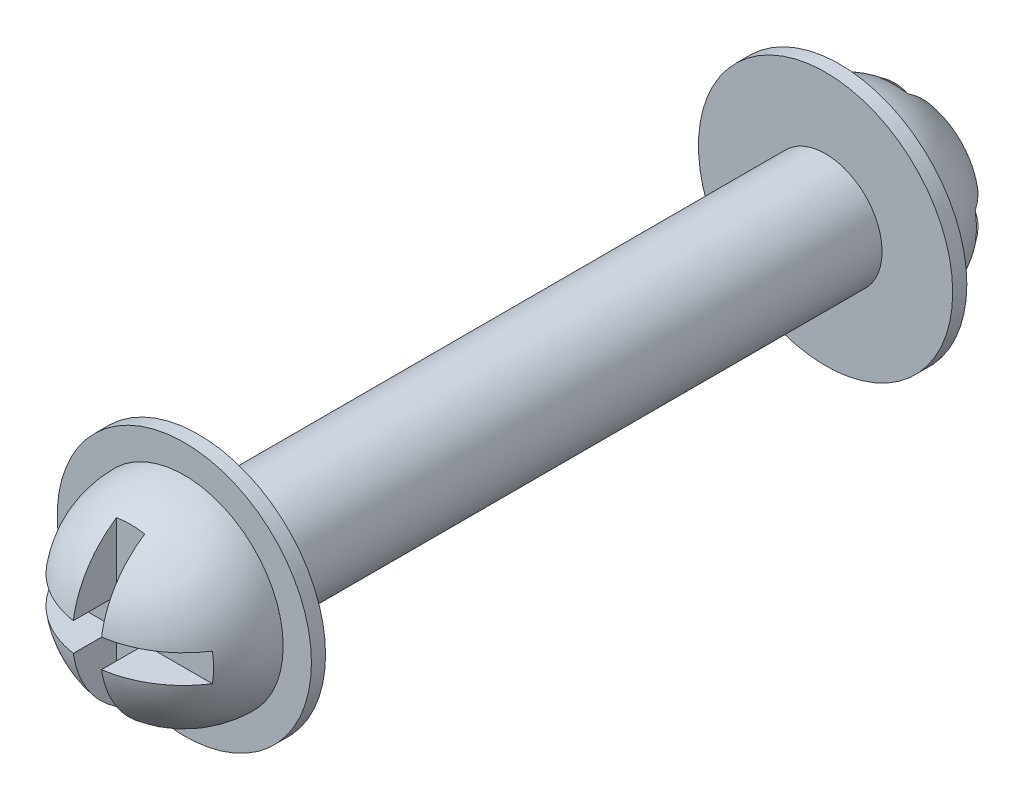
ISO-10303-21;
HEADER;
FILE_DESCRIPTION(('STEP AP214'),'2;1');
FILE_NAME('part.step','',(''),(''),'','','');
FILE_SCHEMA(('AUTOMOTIVE_DESIGN { 1 0 10303 214 1 1 1 1 }'));
ENDSEC;
DATA;
#1=APPLICATION_CONTEXT('core data for automotive mechanical design processes');
#2=APPLICATION_PROTOCOL_DEFINITION('international standard','automotive_design',2000,#1);
#3=PRODUCT_CONTEXT('',#1,'mechanical');
#4=PRODUCT('Part','Part','',(#3));
#5=PRODUCT_RELATED_PRODUCT_CATEGORY('part','',(#4));
#6=PRODUCT_DEFINITION_FORMATION('','',#4);
#7=PRODUCT_DEFINITION_CONTEXT('part definition',#1,'design');
#8=PRODUCT_DEFINITION('design','',#6,#7);
#9=PRODUCT_DEFINITION_SHAPE('','',#8);
#10=(LENGTH_UNIT() NAMED_UNIT(*) SI_UNIT(.MILLI.,.METRE.));
#11=(NAMED_UNIT(*) PLANE_ANGLE_UNIT() SI_UNIT($,.RADIAN.));
#12=(NAMED_UNIT(*) SI_UNIT($,.STERADIAN.) SOLID_ANGLE_UNIT());
#13=UNCERTAINTY_MEASURE_WITH_UNIT(LENGTH_MEASURE(1.E-05),#10,'distance_accuracy_value','');
#14=(GEOMETRIC_REPRESENTATION_CONTEXT(3) GLOBAL_UNCERTAINTY_ASSIGNED_CONTEXT((#13)) GLOBAL_UNIT_ASSIGNED_CONTEXT((#10,
#11,#12)) REPRESENTATION_CONTEXT('',''));
#15=CARTESIAN_POINT('',(0.,0.,0.));
#16=DIRECTION('',(0.,0.,1.));
#17=DIRECTION('',(1.,0.,0.));
#18=AXIS2_PLACEMENT_3D('',#15,#16,#17);
#19=CARTESIAN_POINT('',(-14.2875,1.5875,-49.2125));
#20=DIRECTION('',(0.,1.,0.));
#21=DIRECTION('',(0.,0.,1.));
#22=AXIS2_PLACEMENT_3D('',#19,#20,#21);
#23=PLANE('',#22);
#24=CARTESIAN_POINT('',(0.,1.58749999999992,-36.83));
#25=DIRECTION('',(0.,1.,0.));
#26=DIRECTION('',(0.,0.,1.));
#27=AXIS2_PLACEMENT_3D('',#24,#25,#26);
#28=CIRCLE('',#27,10.9985226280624);
#29=CARTESIAN_POINT('',(-1.5875,1.58749999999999,-47.7133516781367));
#30=VERTEX_POINT('',#29);
#31=CARTESIAN_POINT('',(-9.19654520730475,1.58749999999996,-42.8625));
#32=VERTEX_POINT('',#31);
#33=EDGE_CURVE('E264',#30,#32,#28,.T.);
#34=ORIENTED_EDGE('',*,*,#33,.F.);
#35=DIRECTION('',(0.,0.,1.));
#36=VECTOR('',#35,1.);
#37=CARTESIAN_POINT('',(-1.58749999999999,1.5875,-49.2125));
#38=LINE('',#37,#36);
#39=CARTESIAN_POINT('',(-1.58750000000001,1.58749999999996,-42.8625));
#40=VERTEX_POINT('',#39);
#41=EDGE_CURVE('E177',#30,#40,#38,.T.);
#42=ORIENTED_EDGE('',*,*,#41,.T.);
#43=DIRECTION('',(1.,0.,0.));
#44=VECTOR('',#43,1.);
#45=CARTESIAN_POINT('',(-14.2875,1.58749999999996,-42.8625));
#46=LINE('',#45,#44);
#47=EDGE_CURVE('E210',#32,#40,#46,.T.);
#48=ORIENTED_EDGE('',*,*,#47,.F.);
#49=EDGE_LOOP('',(#34,#42,#48));
#50=FACE_BOUND('',#49,.T.);
#51=ADVANCED_FACE('F35',(#50),#23,.F.);
#52=CARTESIAN_POINT('',(-14.2875,-1.58749999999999,-49.2125));
#53=DIRECTION('',(0.,-1.,0.));
#54=DIRECTION('',(0.,0.,-1.));
#55=AXIS2_PLACEMENT_3D('',#52,#53,#54);
#56=PLANE('',#55);
#57=DIRECTION('',(1.,0.,0.));
#58=VECTOR('',#57,1.);
#59=CARTESIAN_POINT('',(-14.2875,-1.58749999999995,-42.8625));
#60=LINE('',#59,#58);
#61=CARTESIAN_POINT('',(-9.19654520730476,-1.58749999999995,-42.8625));
#62=VERTEX_POINT('',#61);
#63=CARTESIAN_POINT('',(-1.58750000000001,-1.58749999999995,-42.8625));
#64=VERTEX_POINT('',#63);
#65=EDGE_CURVE('E206',#62,#64,#60,.T.);
#66=ORIENTED_EDGE('',*,*,#65,.T.);
#67=DIRECTION('',(0.,0.,-1.));
#68=VECTOR('',#67,1.);
#69=CARTESIAN_POINT('',(-1.58749999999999,-1.58749999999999,-49.2125));
#70=LINE('',#69,#68);
#71=CARTESIAN_POINT('',(-1.5875,-1.58749999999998,-47.7133516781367));
#72=VERTEX_POINT('',#71);
#73=EDGE_CURVE('E279',#64,#72,#70,.T.);
#74=ORIENTED_EDGE('',*,*,#73,.T.);
#75=CARTESIAN_POINT('',(0.,-1.58749999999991,-36.83));
#76=DIRECTION('',(0.,-1.,0.));
#77=DIRECTION('',(0.,0.,-1.));
#78=AXIS2_PLACEMENT_3D('',#75,#76,#77);
#79=CIRCLE('',#78,10.9985226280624);
#80=EDGE_CURVE('E262',#62,#72,#79,.T.);
#81=ORIENTED_EDGE('',*,*,#80,.F.);
#82=EDGE_LOOP('',(#66,#74,#81));
#83=FACE_BOUND('',#82,.T.);
#84=ADVANCED_FACE('F342',(#83),#56,.F.);
#85=CARTESIAN_POINT('',(-14.2875,1.5875,49.2125));
#86=DIRECTION('',(0.,1.,0.));
#87=DIRECTION('',(0.,0.,1.));
#88=AXIS2_PLACEMENT_3D('',#85,#86,#87);
#89=PLANE('',#88);
#90=DIRECTION('',(1.,0.,0.));
#91=VECTOR('',#90,1.);
#92=CARTESIAN_POINT('',(-14.2875,1.5875,42.8625));
#93=LINE('',#92,#91);
#94=CARTESIAN_POINT('',(-9.19654520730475,1.5875,42.8625));
#95=VERTEX_POINT('',#94);
#96=CARTESIAN_POINT('',(-1.58749999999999,1.5875,42.8625));
#97=VERTEX_POINT('',#96);
#98=EDGE_CURVE('E214',#95,#97,#93,.T.);
#99=ORIENTED_EDGE('',*,*,#98,.T.);
#100=DIRECTION('',(0.,0.,1.));
#101=VECTOR('',#100,1.);
#102=CARTESIAN_POINT('',(-1.58749999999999,1.5875,49.2125));
#103=LINE('',#102,#101);
#104=CARTESIAN_POINT('',(-1.58749999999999,1.5875,47.7133516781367));
#105=VERTEX_POINT('',#104);
#106=EDGE_CURVE('E202',#97,#105,#103,.T.);
#107=ORIENTED_EDGE('',*,*,#106,.T.);
#108=CARTESIAN_POINT('',(0.,1.5875,36.83));
#109=DIRECTION('',(0.,1.,0.));
#110=DIRECTION('',(0.,0.,1.));
#111=AXIS2_PLACEMENT_3D('',#108,#109,#110);
#112=CIRCLE('',#111,10.9985226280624);
#113=EDGE_CURVE('E253',#95,#105,#112,.T.);
#114=ORIENTED_EDGE('',*,*,#113,.F.);
#115=EDGE_LOOP('',(#99,#107,#114));
#116=FACE_BOUND('',#115,.T.);
#117=ADVANCED_FACE('F304',(#116),#89,.F.);
#118=CARTESIAN_POINT('',(-14.2875,-1.5875,49.2125));
#119=DIRECTION('',(0.,-1.,0.));
#120=DIRECTION('',(0.,0.,-1.));
#121=AXIS2_PLACEMENT_3D('',#118,#119,#120);
#122=PLANE('',#121);
#123=CARTESIAN_POINT('',(0.,-1.5874999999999,36.83));
#124=DIRECTION('',(0.,-1.,0.));
#125=DIRECTION('',(0.,0.,-1.));
#126=AXIS2_PLACEMENT_3D('',#123,#124,#125);
#127=CIRCLE('',#126,10.9985226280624);
#128=CARTESIAN_POINT('',(-1.58749999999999,-1.58749999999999,47.7133516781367));
#129=VERTEX_POINT('',#128);
#130=CARTESIAN_POINT('',(-9.19654520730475,-1.58749999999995,42.8625));
#131=VERTEX_POINT('',#130);
#132=EDGE_CURVE('E245',#129,#131,#127,.T.);
#133=ORIENTED_EDGE('',*,*,#132,.F.);
#134=DIRECTION('',(0.,0.,-1.));
#135=VECTOR('',#134,1.);
#136=CARTESIAN_POINT('',(-1.58749999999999,-1.5875,49.2125));
#137=LINE('',#136,#135);
#138=CARTESIAN_POINT('',(-1.58749999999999,-1.58749999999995,42.8625));
#139=VERTEX_POINT('',#138);
#140=EDGE_CURVE('E11',#129,#139,#137,.T.);
#141=ORIENTED_EDGE('',*,*,#140,.T.);
#142=DIRECTION('',(1.,0.,0.));
#143=VECTOR('',#142,1.);
#144=CARTESIAN_POINT('',(-14.2875,-1.58749999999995,42.8625));
#145=LINE('',#144,#143);
#146=EDGE_CURVE('E219',#131,#139,#145,.T.);
#147=ORIENTED_EDGE('',*,*,#146,.F.);
#148=EDGE_LOOP('',(#133,#141,#147));
#149=FACE_BOUND('',#148,.T.);
#150=ADVANCED_FACE('F313',(#149),#122,.F.);
#151=CARTESIAN_POINT('',(0.,11.1125,-36.83));
#152=DIRECTION('',(0.,0.,1.));
#153=DIRECTION('',(1.,0.,0.));
#154=AXIS2_PLACEMENT_3D('',#151,#152,#153);
#155=PLANE('',#154);
#156=CARTESIAN_POINT('',(0.,0.,-36.83));
#157=DIRECTION('',(0.,0.,1.));
#158=DIRECTION('',(1.,0.,0.));
#159=AXIS2_PLACEMENT_3D('',#156,#157,#158);
#160=CIRCLE('',#159,14.2875);
#161=CARTESIAN_POINT('',(14.2875,0.,-36.83));
#162=VERTEX_POINT('',#161);
#163=EDGE_CURVE('E242',#162,#162,#160,.T.);
#164=ORIENTED_EDGE('',*,*,#163,.F.);
#165=EDGE_LOOP('',(#164));
#166=FACE_BOUND('',#165,.T.);
#167=CARTESIAN_POINT('',(0.,0.,-36.83));
#168=DIRECTION('',(0.,0.,1.));
#169=DIRECTION('',(1.,0.,0.));
#170=AXIS2_PLACEMENT_3D('',#167,#168,#169);
#171=CIRCLE('',#170,11.1125);
#172=CARTESIAN_POINT('',(11.1125,0.,-36.83));
#173=VERTEX_POINT('',#172);
#174=EDGE_CURVE('E217',#173,#173,#171,.T.);
#175=ORIENTED_EDGE('',*,*,#174,.T.);
#176=EDGE_LOOP('',(#175));
#177=FACE_BOUND('',#176,.T.);
#178=ADVANCED_FACE('F37',(#166,#177),#155,.F.);
#179=CARTESIAN_POINT('',(0.,0.,77.1786132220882));
#180=DIRECTION('',(0.,0.,1.));
#181=DIRECTION('',(1.,0.,0.));
#182=AXIS2_PLACEMENT_3D('',#179,#180,#181);
#183=CYLINDRICAL_SURFACE('',#182,14.2875);
#184=CARTESIAN_POINT('',(0.,0.,-35.2425));
#185=DIRECTION('',(0.,0.,1.));
#186=DIRECTION('',(1.,0.,0.));
#187=AXIS2_PLACEMENT_3D('',#184,#185,#186);
#188=CIRCLE('',#187,14.2875);
#189=CARTESIAN_POINT('',(14.2875,0.,-35.2425));
#190=VERTEX_POINT('',#189);
#191=EDGE_CURVE('E239',#190,#190,#188,.T.);
#192=ORIENTED_EDGE('',*,*,#191,.F.);
#193=EDGE_LOOP('',(#192));
#194=FACE_BOUND('',#193,.T.);
#195=ORIENTED_EDGE('',*,*,#163,.T.);
#196=EDGE_LOOP('',(#195));
#197=FACE_BOUND('',#196,.T.);
#198=ADVANCED_FACE('F368',(#194,#197),#183,.T.);
#199=CARTESIAN_POINT('',(0.,6.35,-35.2425));
#200=DIRECTION('',(0.,0.,-1.));
#201=DIRECTION('',(-1.,0.,0.));
#202=AXIS2_PLACEMENT_3D('',#199,#200,#201);
#203=PLANE('',#202);
#204=CARTESIAN_POINT('',(0.,0.,-35.2425));
#205=DIRECTION('',(0.,0.,1.));
#206=DIRECTION('',(1.,0.,0.));
#207=AXIS2_PLACEMENT_3D('',#204,#205,#206);
#208=CIRCLE('',#207,6.35);
#209=CARTESIAN_POINT('',(6.35,0.,-35.2425));
#210=VERTEX_POINT('',#209);
#211=EDGE_CURVE('E236',#210,#210,#208,.T.);
#212=ORIENTED_EDGE('',*,*,#211,.F.);
#213=EDGE_LOOP('',(#212));
#214=FACE_BOUND('',#213,.T.);
#215=ORIENTED_EDGE('',*,*,#191,.T.);
#216=EDGE_LOOP('',(#215));
#217=FACE_BOUND('',#216,.T.);
#218=ADVANCED_FACE('F396',(#214,#217),#203,.F.);
#219=CARTESIAN_POINT('',(0.,0.,77.1786132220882));
#220=DIRECTION('',(0.,0.,1.));
#221=DIRECTION('',(1.,0.,0.));
#222=AXIS2_PLACEMENT_3D('',#219,#220,#221);
#223=CYLINDRICAL_SURFACE('',#222,6.35);
#224=CARTESIAN_POINT('',(0.,0.,35.2425));
#225=DIRECTION('',(0.,0.,1.));
#226=DIRECTION('',(1.,0.,0.));
#227=AXIS2_PLACEMENT_3D('',#224,#225,#226);
#228=CIRCLE('',#227,6.35);
#229=CARTESIAN_POINT('',(6.35,0.,35.2425));
#230=VERTEX_POINT('',#229);
#231=EDGE_CURVE('E233',#230,#230,#228,.T.);
#232=ORIENTED_EDGE('',*,*,#231,.F.);
#233=EDGE_LOOP('',(#232));
#234=FACE_BOUND('',#233,.T.);
#235=ORIENTED_EDGE('',*,*,#211,.T.);
#236=EDGE_LOOP('',(#235));
#237=FACE_BOUND('',#236,.T.);
#238=ADVANCED_FACE('F392',(#234,#237),#223,.T.);
#239=CARTESIAN_POINT('',(0.,6.35,35.2425));
#240=DIRECTION('',(0.,0.,1.));
#241=DIRECTION('',(1.,0.,0.));
#242=AXIS2_PLACEMENT_3D('',#239,#240,#241);
#243=PLANE('',#242);
#244=CARTESIAN_POINT('',(0.,0.,35.2425));
#245=DIRECTION('',(0.,0.,1.));
#246=DIRECTION('',(1.,0.,0.));
#247=AXIS2_PLACEMENT_3D('',#244,#245,#246);
#248=CIRCLE('',#247,14.2875);
#249=CARTESIAN_POINT('',(14.2875,0.,35.2425));
#250=VERTEX_POINT('',#249);
#251=EDGE_CURVE('E230',#250,#250,#248,.T.);
#252=ORIENTED_EDGE('',*,*,#251,.F.);
#253=EDGE_LOOP('',(#252));
#254=FACE_BOUND('',#253,.T.);
#255=ORIENTED_EDGE('',*,*,#231,.T.);
#256=EDGE_LOOP('',(#255));
#257=FACE_BOUND('',#256,.T.);
#258=ADVANCED_FACE('F388',(#254,#257),#243,.F.);
#259=CARTESIAN_POINT('',(0.,0.,77.1786132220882));
#260=DIRECTION('',(0.,0.,1.));
#261=DIRECTION('',(1.,0.,0.));
#262=AXIS2_PLACEMENT_3D('',#259,#260,#261);
#263=CYLINDRICAL_SURFACE('',#262,14.2875);
#264=CARTESIAN_POINT('',(0.,0.,36.83));
#265=DIRECTION('',(0.,0.,1.));
#266=DIRECTION('',(1.,0.,0.));
#267=AXIS2_PLACEMENT_3D('',#264,#265,#266);
#268=CIRCLE('',#267,14.2875);
#269=CARTESIAN_POINT('',(14.2875,0.,36.83));
#270=VERTEX_POINT('',#269);
#271=EDGE_CURVE('E227',#270,#270,#268,.T.);
#272=ORIENTED_EDGE('',*,*,#271,.F.);
#273=EDGE_LOOP('',(#272));
#274=FACE_BOUND('',#273,.T.);
#275=ORIENTED_EDGE('',*,*,#251,.T.);
#276=EDGE_LOOP('',(#275));
#277=FACE_BOUND('',#276,.T.);
#278=ADVANCED_FACE('F384',(#274,#277),#263,.T.);
#279=CARTESIAN_POINT('',(0.,11.1125,36.83));
#280=DIRECTION('',(0.,0.,-1.));
#281=DIRECTION('',(-1.,0.,0.));
#282=AXIS2_PLACEMENT_3D('',#279,#280,#281);
#283=PLANE('',#282);
#284=CARTESIAN_POINT('',(0.,0.,36.83));
#285=DIRECTION('',(0.,0.,1.));
#286=DIRECTION('',(1.,0.,0.));
#287=AXIS2_PLACEMENT_3D('',#284,#285,#286);
#288=CIRCLE('',#287,11.1125);
#289=CARTESIAN_POINT('',(11.1125,0.,36.83));
#290=VERTEX_POINT('',#289);
#291=EDGE_CURVE('E224',#290,#290,#288,.T.);
#292=ORIENTED_EDGE('',*,*,#291,.F.);
#293=EDGE_LOOP('',(#292));
#294=FACE_BOUND('',#293,.T.);
#295=ORIENTED_EDGE('',*,*,#271,.T.);
#296=EDGE_LOOP('',(#295));
#297=FACE_BOUND('',#296,.T.);
#298=ADVANCED_FACE('F379',(#294,#297),#283,.F.);
#299=CARTESIAN_POINT('',(0.,0.,36.83));
#300=DIRECTION('',(0.,0.,1.));
#301=DIRECTION('',(0.,1.,0.));
#302=AXIS2_PLACEMENT_3D('',#299,#300,#301);
#303=SPHERICAL_SURFACE('',#302,11.1125);
#304=ORIENTED_EDGE('',*,*,#113,.T.);
#305=CARTESIAN_POINT('',(-1.58749999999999,0.,36.83));
#306=DIRECTION('',(-1.,0.,0.));
#307=DIRECTION('',(0.,0.,1.));
#308=AXIS2_PLACEMENT_3D('',#305,#306,#307);
#309=CIRCLE('',#308,10.9985226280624);
#310=CARTESIAN_POINT('',(-1.58749999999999,9.19654520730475,42.8625));
#311=VERTEX_POINT('',#310);
#312=EDGE_CURVE('E203',#105,#311,#309,.T.);
#313=ORIENTED_EDGE('',*,*,#312,.T.);
#314=CARTESIAN_POINT('',(0.,0.,42.8625));
#315=DIRECTION('',(0.,0.,-1.));
#316=DIRECTION('',(-1.,0.,0.));
#317=AXIS2_PLACEMENT_3D('',#314,#315,#316);
#318=CIRCLE('',#317,9.3325559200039);
#319=CARTESIAN_POINT('',(1.58750000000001,9.19654520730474,42.8625));
#320=VERTEX_POINT('',#319);
#321=EDGE_CURVE('E198',#311,#320,#318,.T.);
#322=ORIENTED_EDGE('',*,*,#321,.T.);
#323=CARTESIAN_POINT('',(1.58750000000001,0.,36.83));
#324=DIRECTION('',(1.,0.,0.));
#325=DIRECTION('',(0.,0.,-1.));
#326=AXIS2_PLACEMENT_3D('',#323,#324,#325);
#327=CIRCLE('',#326,10.9985226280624);
#328=CARTESIAN_POINT('',(1.58750000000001,1.5875,47.7133516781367));
#329=VERTEX_POINT('',#328);
#330=EDGE_CURVE('E192',#320,#329,#327,.T.);
#331=ORIENTED_EDGE('',*,*,#330,.T.);
#332=CARTESIAN_POINT('',(9.19654520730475,1.5875,42.8625));
#333=VERTEX_POINT('',#332);
#334=EDGE_CURVE('E257',#329,#333,#112,.T.);
#335=ORIENTED_EDGE('',*,*,#334,.T.);
#336=CARTESIAN_POINT('',(0.,0.,42.8625));
#337=DIRECTION('',(0.,0.,-1.));
#338=DIRECTION('',(-1.,0.,0.));
#339=AXIS2_PLACEMENT_3D('',#336,#337,#338);
#340=CIRCLE('',#339,9.3325559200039);
#341=CARTESIAN_POINT('',(9.19654520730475,-1.58749999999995,42.8625));
#342=VERTEX_POINT('',#341);
#343=EDGE_CURVE('E252',#333,#342,#340,.T.);
#344=ORIENTED_EDGE('',*,*,#343,.T.);
#345=CARTESIAN_POINT('',(1.58750000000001,-1.58749999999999,47.7133516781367));
#346=VERTEX_POINT('',#345);
#347=EDGE_CURVE('E246',#342,#346,#127,.T.);
#348=ORIENTED_EDGE('',*,*,#347,.T.);
#349=CARTESIAN_POINT('',(1.58750000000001,-9.19654520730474,42.8625));
#350=VERTEX_POINT('',#349);
#351=EDGE_CURVE('E188',#346,#350,#327,.T.);
#352=ORIENTED_EDGE('',*,*,#351,.T.);
#353=CARTESIAN_POINT('',(-1.58749999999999,-9.19654520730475,42.8625));
#354=VERTEX_POINT('',#353);
#355=EDGE_CURVE('E195',#350,#354,#318,.T.);
#356=ORIENTED_EDGE('',*,*,#355,.T.);
#357=EDGE_CURVE('E199',#354,#129,#309,.T.);
#358=ORIENTED_EDGE('',*,*,#357,.T.);
#359=ORIENTED_EDGE('',*,*,#132,.T.);
#360=EDGE_CURVE('E249',#131,#95,#340,.T.);
#361=ORIENTED_EDGE('',*,*,#360,.T.);
#362=EDGE_LOOP('',(#304,#313,#322,#331,#335,#344,#348,#352,#356,#358,#359,#361));
#363=FACE_BOUND('',#362,.T.);
#364=ORIENTED_EDGE('',*,*,#291,.T.);
#365=EDGE_LOOP('',(#364));
#366=FACE_BOUND('',#365,.T.);
#367=ADVANCED_FACE('F297',(#363,#366),#303,.T.);
#368=CARTESIAN_POINT('',(0.,0.,-36.83));
#369=DIRECTION('',(0.,0.,1.));
#370=DIRECTION('',(0.,-1.,0.));
#371=AXIS2_PLACEMENT_3D('',#368,#369,#370);
#372=SPHERICAL_SURFACE('',#371,11.1125);
#373=CARTESIAN_POINT('',(0.,0.,-42.8625));
#374=DIRECTION('',(0.,0.,1.));
#375=DIRECTION('',(1.,0.,0.));
#376=AXIS2_PLACEMENT_3D('',#373,#374,#375);
#377=CIRCLE('',#376,9.3325559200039);
#378=CARTESIAN_POINT('',(1.58750000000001,9.19654520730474,-42.8625));
#379=VERTEX_POINT('',#378);
#380=CARTESIAN_POINT('',(-1.58750000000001,9.19654520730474,-42.8625));
#381=VERTEX_POINT('',#380);
#382=EDGE_CURVE('E172',#379,#381,#377,.T.);
#383=ORIENTED_EDGE('',*,*,#382,.T.);
#384=CARTESIAN_POINT('',(-1.58750000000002,0.,-36.83));
#385=DIRECTION('',(-1.,0.,0.));
#386=DIRECTION('',(0.,0.,1.));
#387=AXIS2_PLACEMENT_3D('',#384,#385,#386);
#388=CIRCLE('',#387,10.9985226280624);
#389=EDGE_CURVE('E173',#381,#30,#388,.T.);
#390=ORIENTED_EDGE('',*,*,#389,.T.);
#391=ORIENTED_EDGE('',*,*,#33,.T.);
#392=CARTESIAN_POINT('',(0.,0.,-42.8625));
#393=DIRECTION('',(0.,0.,1.));
#394=DIRECTION('',(1.,0.,0.));
#395=AXIS2_PLACEMENT_3D('',#392,#393,#394);
#396=CIRCLE('',#395,9.3325559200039);
#397=EDGE_CURVE('E261',#32,#62,#396,.T.);
#398=ORIENTED_EDGE('',*,*,#397,.T.);
#399=ORIENTED_EDGE('',*,*,#80,.T.);
#400=CARTESIAN_POINT('',(-1.58750000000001,-9.19654520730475,-42.8625));
#401=VERTEX_POINT('',#400);
#402=EDGE_CURVE('E171',#72,#401,#388,.T.);
#403=ORIENTED_EDGE('',*,*,#402,.T.);
#404=CARTESIAN_POINT('',(1.58750000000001,-9.19654520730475,-42.8625));
#405=VERTEX_POINT('',#404);
#406=EDGE_CURVE('E161',#401,#405,#377,.T.);
#407=ORIENTED_EDGE('',*,*,#406,.T.);
#408=CARTESIAN_POINT('',(1.58750000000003,0.,-36.83));
#409=DIRECTION('',(1.,0.,0.));
#410=DIRECTION('',(0.,0.,-1.));
#411=AXIS2_PLACEMENT_3D('',#408,#409,#410);
#412=CIRCLE('',#411,10.9985226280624);
#413=CARTESIAN_POINT('',(1.5875,-1.58749999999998,-47.7133516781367));
#414=VERTEX_POINT('',#413);
#415=EDGE_CURVE('E147',#405,#414,#412,.T.);
#416=ORIENTED_EDGE('',*,*,#415,.T.);
#417=CARTESIAN_POINT('',(9.19654520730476,-1.58749999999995,-42.8625));
#418=VERTEX_POINT('',#417);
#419=EDGE_CURVE('E260',#414,#418,#79,.T.);
#420=ORIENTED_EDGE('',*,*,#419,.T.);
#421=CARTESIAN_POINT('',(9.19654520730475,1.58749999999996,-42.8625));
#422=VERTEX_POINT('',#421);
#423=EDGE_CURVE('E256',#418,#422,#396,.T.);
#424=ORIENTED_EDGE('',*,*,#423,.T.);
#425=CARTESIAN_POINT('',(1.5875,1.58749999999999,-47.7133516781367));
#426=VERTEX_POINT('',#425);
#427=EDGE_CURVE('E265',#422,#426,#28,.T.);
#428=ORIENTED_EDGE('',*,*,#427,.T.);
#429=EDGE_CURVE('E158',#426,#379,#412,.T.);
#430=ORIENTED_EDGE('',*,*,#429,.T.);
#431=EDGE_LOOP('',(#383,#390,#391,#398,#399,#403,#407,#416,#420,#424,#428,#430));
#432=FACE_BOUND('',#431,.T.);
#433=ORIENTED_EDGE('',*,*,#174,.F.);
#434=EDGE_LOOP('',(#433));
#435=FACE_BOUND('',#434,.T.);
#436=ADVANCED_FACE('F168',(#432,#435),#372,.T.);
#437=ORIENTED_EDGE('',*,*,#334,.F.);
#438=DIRECTION('',(0.,0.,-1.));
#439=VECTOR('',#438,1.);
#440=CARTESIAN_POINT('',(1.58750000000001,1.5875,49.2125));
#441=LINE('',#440,#439);
#442=CARTESIAN_POINT('',(1.58750000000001,1.5875,42.8625));
#443=VERTEX_POINT('',#442);
#444=EDGE_CURVE('E191',#329,#443,#441,.T.);
#445=ORIENTED_EDGE('',*,*,#444,.T.);
#446=EDGE_CURVE('E218',#443,#333,#93,.T.);
#447=ORIENTED_EDGE('',*,*,#446,.T.);
#448=EDGE_LOOP('',(#437,#445,#447));
#449=FACE_BOUND('',#448,.T.);
#450=ADVANCED_FACE('F326',(#449),#89,.F.);
#451=CARTESIAN_POINT('',(-14.2875,1.5875,42.8625));
#452=DIRECTION('',(0.,0.,-1.));
#453=DIRECTION('',(-1.,0.,0.));
#454=AXIS2_PLACEMENT_3D('',#451,#452,#453);
#455=PLANE('',#454);
#456=ORIENTED_EDGE('',*,*,#446,.F.);
#457=DIRECTION('',(0.,1.,0.));
#458=VECTOR('',#457,1.);
#459=CARTESIAN_POINT('',(1.58750000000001,-14.2875,42.8625));
#460=LINE('',#459,#458);
#461=EDGE_CURVE('E175',#443,#320,#460,.T.);
#462=ORIENTED_EDGE('',*,*,#461,.T.);
#463=ORIENTED_EDGE('',*,*,#321,.F.);
#464=DIRECTION('',(0.,1.,0.));
#465=VECTOR('',#464,1.);
#466=CARTESIAN_POINT('',(-1.58749999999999,-14.2875,42.8625));
#467=LINE('',#466,#465);
#468=EDGE_CURVE('E181',#97,#311,#467,.T.);
#469=ORIENTED_EDGE('',*,*,#468,.F.);
#470=ORIENTED_EDGE('',*,*,#98,.F.);
#471=ORIENTED_EDGE('',*,*,#360,.F.);
#472=ORIENTED_EDGE('',*,*,#146,.T.);
#473=EDGE_CURVE('E184',#354,#139,#467,.T.);
#474=ORIENTED_EDGE('',*,*,#473,.F.);
#475=ORIENTED_EDGE('',*,*,#355,.F.);
#476=CARTESIAN_POINT('',(1.58750000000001,-1.58749999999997,42.8625));
#477=VERTEX_POINT('',#476);
#478=EDGE_CURVE('E185',#350,#477,#460,.T.);
#479=ORIENTED_EDGE('',*,*,#478,.T.);
#480=EDGE_CURVE('E209',#477,#342,#145,.T.);
#481=ORIENTED_EDGE('',*,*,#480,.T.);
#482=ORIENTED_EDGE('',*,*,#343,.F.);
#483=EDGE_LOOP('',(#456,#462,#463,#469,#470,#471,#472,#474,#475,#479,#481,#482));
#484=FACE_BOUND('',#483,.T.);
#485=ADVANCED_FACE('F309',(#484),#455,.F.);
#486=ORIENTED_EDGE('',*,*,#480,.F.);
#487=DIRECTION('',(0.,0.,1.));
#488=VECTOR('',#487,1.);
#489=CARTESIAN_POINT('',(1.58750000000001,-1.5875,49.2125));
#490=LINE('',#489,#488);
#491=EDGE_CURVE('E43',#477,#346,#490,.T.);
#492=ORIENTED_EDGE('',*,*,#491,.T.);
#493=ORIENTED_EDGE('',*,*,#347,.F.);
#494=EDGE_LOOP('',(#486,#492,#493));
#495=FACE_BOUND('',#494,.T.);
#496=ADVANCED_FACE('F322',(#495),#122,.F.);
#497=CARTESIAN_POINT('',(1.58750000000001,1.58749999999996,-42.8625));
#498=VERTEX_POINT('',#497);
#499=EDGE_CURVE('E213',#498,#422,#46,.T.);
#500=ORIENTED_EDGE('',*,*,#499,.F.);
#501=DIRECTION('',(0.,0.,-1.));
#502=VECTOR('',#501,1.);
#503=CARTESIAN_POINT('',(1.58749999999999,1.5875,-49.2125));
#504=LINE('',#503,#502);
#505=EDGE_CURVE('E156',#498,#426,#504,.T.);
#506=ORIENTED_EDGE('',*,*,#505,.T.);
#507=ORIENTED_EDGE('',*,*,#427,.F.);
#508=EDGE_LOOP('',(#500,#506,#507));
#509=FACE_BOUND('',#508,.T.);
#510=ADVANCED_FACE('F293',(#509),#23,.F.);
#511=ORIENTED_EDGE('',*,*,#419,.F.);
#512=DIRECTION('',(0.,0.,1.));
#513=VECTOR('',#512,1.);
#514=CARTESIAN_POINT('',(1.58749999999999,-1.58749999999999,-49.2125));
#515=LINE('',#514,#513);
#516=CARTESIAN_POINT('',(1.58750000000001,-1.58749999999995,-42.8625));
#517=VERTEX_POINT('',#516);
#518=EDGE_CURVE('E152',#414,#517,#515,.T.);
#519=ORIENTED_EDGE('',*,*,#518,.T.);
#520=EDGE_CURVE('E164',#517,#418,#60,.T.);
#521=ORIENTED_EDGE('',*,*,#520,.T.);
#522=EDGE_LOOP('',(#511,#519,#521));
#523=FACE_BOUND('',#522,.T.);
#524=ADVANCED_FACE('F348',(#523),#56,.F.);
#525=CARTESIAN_POINT('',(-14.2875,1.58749999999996,-42.8625));
#526=DIRECTION('',(0.,0.,1.));
#527=DIRECTION('',(1.,0.,0.));
#528=AXIS2_PLACEMENT_3D('',#525,#526,#527);
#529=PLANE('',#528);
#530=ORIENTED_EDGE('',*,*,#520,.F.);
#531=DIRECTION('',(0.,1.,0.));
#532=VECTOR('',#531,1.);
#533=CARTESIAN_POINT('',(1.58750000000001,-14.2875,-42.8625));
#534=LINE('',#533,#532);
#535=EDGE_CURVE('E150',#405,#517,#534,.T.);
#536=ORIENTED_EDGE('',*,*,#535,.F.);
#537=ORIENTED_EDGE('',*,*,#406,.F.);
#538=DIRECTION('',(0.,1.,0.));
#539=VECTOR('',#538,1.);
#540=CARTESIAN_POINT('',(-1.58750000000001,-14.2875,-42.8625));
#541=LINE('',#540,#539);
#542=EDGE_CURVE('E50',#401,#64,#541,.T.);
#543=ORIENTED_EDGE('',*,*,#542,.T.);
#544=ORIENTED_EDGE('',*,*,#65,.F.);
#545=ORIENTED_EDGE('',*,*,#397,.F.);
#546=ORIENTED_EDGE('',*,*,#47,.T.);
#547=EDGE_CURVE('E286',#40,#381,#541,.T.);
#548=ORIENTED_EDGE('',*,*,#547,.T.);
#549=ORIENTED_EDGE('',*,*,#382,.F.);
#550=EDGE_CURVE('E57',#498,#379,#534,.T.);
#551=ORIENTED_EDGE('',*,*,#550,.F.);
#552=ORIENTED_EDGE('',*,*,#499,.T.);
#553=ORIENTED_EDGE('',*,*,#423,.F.);
#554=EDGE_LOOP('',(#530,#536,#537,#543,#544,#545,#546,#548,#549,#551,#552,#553));
#555=FACE_BOUND('',#554,.T.);
#556=ADVANCED_FACE('F160',(#555),#529,.F.);
#557=CARTESIAN_POINT('',(1.58750000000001,-14.2875,50.4825));
#558=DIRECTION('',(1.,0.,0.));
#559=DIRECTION('',(0.,0.,-1.));
#560=AXIS2_PLACEMENT_3D('',#557,#558,#559);
#561=PLANE('',#560);
#562=ORIENTED_EDGE('',*,*,#491,.F.);
#563=ORIENTED_EDGE('',*,*,#478,.F.);
#564=ORIENTED_EDGE('',*,*,#351,.F.);
#565=EDGE_LOOP('',(#562,#563,#564));
#566=FACE_BOUND('',#565,.T.);
#567=ADVANCED_FACE('F320',(#566),#561,.F.);
#568=CARTESIAN_POINT('',(-1.58749999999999,-14.2875,50.4825));
#569=DIRECTION('',(-1.,0.,0.));
#570=DIRECTION('',(0.,0.,1.));
#571=AXIS2_PLACEMENT_3D('',#568,#569,#570);
#572=PLANE('',#571);
#573=ORIENTED_EDGE('',*,*,#473,.T.);
#574=ORIENTED_EDGE('',*,*,#140,.F.);
#575=ORIENTED_EDGE('',*,*,#357,.F.);
#576=EDGE_LOOP('',(#573,#574,#575));
#577=FACE_BOUND('',#576,.T.);
#578=ADVANCED_FACE('F337',(#577),#572,.F.);
#579=ORIENTED_EDGE('',*,*,#106,.F.);
#580=ORIENTED_EDGE('',*,*,#468,.T.);
#581=ORIENTED_EDGE('',*,*,#312,.F.);
#582=EDGE_LOOP('',(#579,#580,#581));
#583=FACE_BOUND('',#582,.T.);
#584=ADVANCED_FACE('F301',(#583),#572,.F.);
#585=ORIENTED_EDGE('',*,*,#461,.F.);
#586=ORIENTED_EDGE('',*,*,#444,.F.);
#587=ORIENTED_EDGE('',*,*,#330,.F.);
#588=EDGE_LOOP('',(#585,#586,#587));
#589=FACE_BOUND('',#588,.T.);
#590=ADVANCED_FACE('F328',(#589),#561,.F.);
#591=CARTESIAN_POINT('',(1.58749999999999,-14.2875,-50.4825));
#592=DIRECTION('',(1.,0.,0.));
#593=DIRECTION('',(0.,0.,-1.));
#594=AXIS2_PLACEMENT_3D('',#591,#592,#593);
#595=PLANE('',#594);
#596=ORIENTED_EDGE('',*,*,#535,.T.);
#597=ORIENTED_EDGE('',*,*,#518,.F.);
#598=ORIENTED_EDGE('',*,*,#415,.F.);
#599=EDGE_LOOP('',(#596,#597,#598));
#600=FACE_BOUND('',#599,.T.);
#601=ADVANCED_FACE('F149',(#600),#595,.F.);
#602=CARTESIAN_POINT('',(-1.58749999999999,-14.2875,-50.4825));
#603=DIRECTION('',(-1.,0.,0.));
#604=DIRECTION('',(0.,0.,1.));
#605=AXIS2_PLACEMENT_3D('',#602,#603,#604);
#606=PLANE('',#605);
#607=ORIENTED_EDGE('',*,*,#73,.F.);
#608=ORIENTED_EDGE('',*,*,#542,.F.);
#609=ORIENTED_EDGE('',*,*,#402,.F.);
#610=EDGE_LOOP('',(#607,#608,#609));
#611=FACE_BOUND('',#610,.T.);
#612=ADVANCED_FACE('F335',(#611),#606,.F.);
#613=ORIENTED_EDGE('',*,*,#547,.F.);
#614=ORIENTED_EDGE('',*,*,#41,.F.);
#615=ORIENTED_EDGE('',*,*,#389,.F.);
#616=EDGE_LOOP('',(#613,#614,#615));
#617=FACE_BOUND('',#616,.T.);
#618=ADVANCED_FACE('F514',(#617),#606,.F.);
#619=ORIENTED_EDGE('',*,*,#505,.F.);
#620=ORIENTED_EDGE('',*,*,#550,.T.);
#621=ORIENTED_EDGE('',*,*,#429,.F.);
#622=EDGE_LOOP('',(#619,#620,#621));
#623=FACE_BOUND('',#622,.T.);
#624=ADVANCED_FACE('F289',(#623),#595,.F.);
#625=CLOSED_SHELL('',(#51,#84,#117,#150,#178,#198,#218,#238,#258,#278,#298,#367,#436,#450,#485,
#496,#510,#524,#556,#567,#578,#584,#590,#601,#612,#618,#624));
#626=MANIFOLD_SOLID_BREP('B2',#625);
#627=ADVANCED_BREP_SHAPE_REPRESENTATION('',(#18,#626),#14);
#628=SHAPE_DEFINITION_REPRESENTATION(#9,#627);
ENDSEC;
END-ISO-10303-21;
